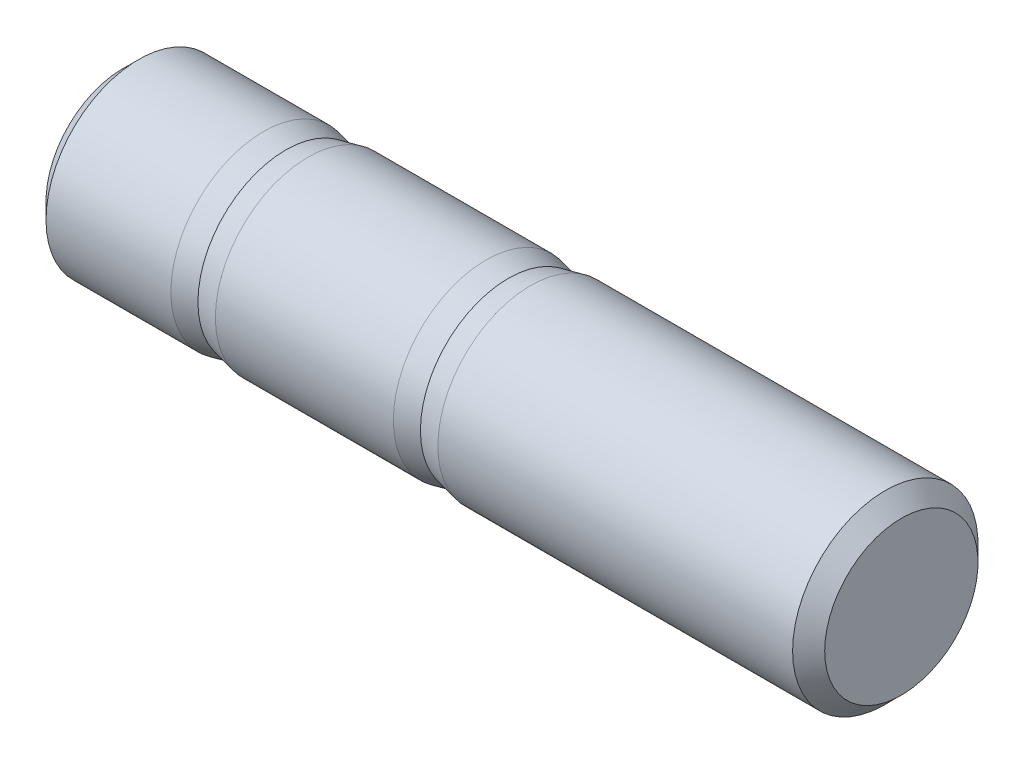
ISO-10303-21;
HEADER;
FILE_DESCRIPTION(('STEP AP214'),'2;1');
FILE_NAME('part.step','',(''),(''),'','','');
FILE_SCHEMA(('AUTOMOTIVE_DESIGN { 1 0 10303 214 1 1 1 1 }'));
ENDSEC;
DATA;
#1=APPLICATION_CONTEXT('core data for automotive mechanical design processes');
#2=APPLICATION_PROTOCOL_DEFINITION('international standard','automotive_design',2000,#1);
#3=PRODUCT_CONTEXT('',#1,'mechanical');
#4=PRODUCT('Part','Part','',(#3));
#5=PRODUCT_RELATED_PRODUCT_CATEGORY('part','',(#4));
#6=PRODUCT_DEFINITION_FORMATION('','',#4);
#7=PRODUCT_DEFINITION_CONTEXT('part definition',#1,'design');
#8=PRODUCT_DEFINITION('design','',#6,#7);
#9=PRODUCT_DEFINITION_SHAPE('','',#8);
#10=(LENGTH_UNIT() NAMED_UNIT(*) SI_UNIT(.MILLI.,.METRE.));
#11=(NAMED_UNIT(*) PLANE_ANGLE_UNIT() SI_UNIT($,.RADIAN.));
#12=(NAMED_UNIT(*) SI_UNIT($,.STERADIAN.) SOLID_ANGLE_UNIT());
#13=UNCERTAINTY_MEASURE_WITH_UNIT(LENGTH_MEASURE(1.E-05),#10,'distance_accuracy_value','');
#14=(GEOMETRIC_REPRESENTATION_CONTEXT(3) GLOBAL_UNCERTAINTY_ASSIGNED_CONTEXT((#13)) GLOBAL_UNIT_ASSIGNED_CONTEXT((#10,
#11,#12)) REPRESENTATION_CONTEXT('',''));
#15=CARTESIAN_POINT('',(0.,0.,0.));
#16=DIRECTION('',(0.,0.,1.));
#17=DIRECTION('',(1.,0.,0.));
#18=AXIS2_PLACEMENT_3D('',#15,#16,#17);
#19=CARTESIAN_POINT('',(5.,0.,0.));
#20=DIRECTION('',(-1.,0.,0.));
#21=DIRECTION('',(0.,0.,1.));
#22=AXIS2_PLACEMENT_3D('',#19,#20,#21);
#23=CONICAL_SURFACE('',#22,2.24,0.213368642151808);
#24=CARTESIAN_POINT('',(3.8,0.,0.));
#25=DIRECTION('',(-1.,0.,0.));
#26=DIRECTION('',(0.,0.,1.));
#27=AXIS2_PLACEMENT_3D('',#24,#25,#26);
#28=CIRCLE('',#27,2.5);
#29=CARTESIAN_POINT('',(3.8,0.,2.5));
#30=VERTEX_POINT('',#29);
#31=EDGE_CURVE('E54',#30,#30,#28,.T.);
#32=ORIENTED_EDGE('',*,*,#31,.F.);
#33=EDGE_LOOP('',(#32));
#34=FACE_BOUND('',#33,.T.);
#35=CARTESIAN_POINT('',(4.4,0.,0.));
#36=DIRECTION('',(1.,0.,0.));
#37=DIRECTION('',(0.,0.,-1.));
#38=AXIS2_PLACEMENT_3D('',#35,#36,#37);
#39=CIRCLE('',#38,2.37);
#40=CARTESIAN_POINT('',(4.4,0.,-2.37));
#41=VERTEX_POINT('',#40);
#42=EDGE_CURVE('E10',#41,#41,#39,.T.);
#43=ORIENTED_EDGE('',*,*,#42,.F.);
#44=EDGE_LOOP('',(#43));
#45=FACE_BOUND('',#44,.T.);
#46=ADVANCED_FACE('F28',(#34,#45),#23,.T.);
#47=CARTESIAN_POINT('',(0.,0.,0.));
#48=DIRECTION('',(1.,0.,0.));
#49=DIRECTION('',(0.,0.,-1.));
#50=AXIS2_PLACEMENT_3D('',#47,#48,#49);
#51=PLANE('',#50);
#52=CARTESIAN_POINT('',(0.,0.,0.));
#53=DIRECTION('',(1.,0.,0.));
#54=DIRECTION('',(0.,0.,-1.));
#55=AXIS2_PLACEMENT_3D('',#52,#53,#54);
#56=CIRCLE('',#55,2.067);
#57=CARTESIAN_POINT('',(0.,0.,-2.067));
#58=VERTEX_POINT('',#57);
#59=EDGE_CURVE('E51',#58,#58,#56,.F.);
#60=ORIENTED_EDGE('',*,*,#59,.T.);
#61=EDGE_LOOP('',(#60));
#62=FACE_BOUND('',#61,.T.);
#63=ADVANCED_FACE('F86',(#62),#51,.F.);
#64=CARTESIAN_POINT('',(-1.31084166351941,0.,0.));
#65=DIRECTION('',(-1.,0.,0.));
#66=DIRECTION('',(0.,0.,1.));
#67=AXIS2_PLACEMENT_3D('',#64,#65,#66);
#68=CYLINDRICAL_SURFACE('',#67,2.5);
#69=CARTESIAN_POINT('',(0.433,0.,0.));
#70=DIRECTION('',(1.,0.,0.));
#71=DIRECTION('',(0.,0.,-1.));
#72=AXIS2_PLACEMENT_3D('',#69,#70,#71);
#73=CIRCLE('',#72,2.5);
#74=CARTESIAN_POINT('',(0.433,0.,-2.5));
#75=VERTEX_POINT('',#74);
#76=EDGE_CURVE('E48',#75,#75,#73,.T.);
#77=ORIENTED_EDGE('',*,*,#76,.T.);
#78=EDGE_LOOP('',(#77));
#79=FACE_BOUND('',#78,.T.);
#80=ORIENTED_EDGE('',*,*,#31,.T.);
#81=EDGE_LOOP('',(#80));
#82=FACE_BOUND('',#81,.T.);
#83=ADVANCED_FACE('F92',(#79,#82),#68,.T.);
#84=CARTESIAN_POINT('',(0.,0.,0.));
#85=DIRECTION('',(1.,0.,0.));
#86=DIRECTION('',(0.,0.,-1.));
#87=AXIS2_PLACEMENT_3D('',#84,#85,#86);
#88=CONICAL_SURFACE('',#87,2.067,0.785398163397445);
#89=CARTESIAN_POINT('',(0.433,0.,-2.5));
#90=CARTESIAN_POINT('',(0.428489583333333,0.,-2.49548958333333));
#91=CARTESIAN_POINT('',(0.423979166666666,0.,-2.49097916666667));
#92=CARTESIAN_POINT('',(0.414958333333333,0.,-2.48195833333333));
#93=CARTESIAN_POINT('',(0.410447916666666,0.,-2.47744791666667));
#94=CARTESIAN_POINT('',(0.401427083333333,0.,-2.46842708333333));
#95=CARTESIAN_POINT('',(0.396916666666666,0.,-2.46391666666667));
#96=CARTESIAN_POINT('',(0.387895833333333,0.,-2.45489583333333));
#97=CARTESIAN_POINT('',(0.383385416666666,0.,-2.45038541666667));
#98=CARTESIAN_POINT('',(0.374364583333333,0.,-2.44136458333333));
#99=CARTESIAN_POINT('',(0.369854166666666,0.,-2.43685416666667));
#100=CARTESIAN_POINT('',(0.360833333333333,0.,-2.42783333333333));
#101=CARTESIAN_POINT('',(0.356322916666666,0.,-2.42332291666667));
#102=CARTESIAN_POINT('',(0.347302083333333,0.,-2.41430208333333));
#103=CARTESIAN_POINT('',(0.342791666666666,0.,-2.40979166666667));
#104=CARTESIAN_POINT('',(0.333770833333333,0.,-2.40077083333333));
#105=CARTESIAN_POINT('',(0.329260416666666,0.,-2.39626041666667));
#106=CARTESIAN_POINT('',(0.320239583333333,0.,-2.38723958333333));
#107=CARTESIAN_POINT('',(0.315729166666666,0.,-2.38272916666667));
#108=CARTESIAN_POINT('',(0.306708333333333,0.,-2.37370833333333));
#109=CARTESIAN_POINT('',(0.302197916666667,0.,-2.36919791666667));
#110=CARTESIAN_POINT('',(0.293177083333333,0.,-2.36017708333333));
#111=CARTESIAN_POINT('',(0.288666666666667,0.,-2.35566666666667));
#112=CARTESIAN_POINT('',(0.279645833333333,0.,-2.34664583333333));
#113=CARTESIAN_POINT('',(0.275135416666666,0.,-2.34213541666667));
#114=CARTESIAN_POINT('',(0.266114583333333,0.,-2.33311458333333));
#115=CARTESIAN_POINT('',(0.261604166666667,0.,-2.32860416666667));
#116=CARTESIAN_POINT('',(0.252583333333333,0.,-2.31958333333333));
#117=CARTESIAN_POINT('',(0.248072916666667,0.,-2.31507291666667));
#118=CARTESIAN_POINT('',(0.239052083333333,0.,-2.30605208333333));
#119=CARTESIAN_POINT('',(0.234541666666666,0.,-2.30154166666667));
#120=CARTESIAN_POINT('',(0.225520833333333,0.,-2.29252083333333));
#121=CARTESIAN_POINT('',(0.221010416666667,0.,-2.28801041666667));
#122=CARTESIAN_POINT('',(0.211989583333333,0.,-2.27898958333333));
#123=CARTESIAN_POINT('',(0.207479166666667,0.,-2.27447916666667));
#124=CARTESIAN_POINT('',(0.198458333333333,0.,-2.26545833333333));
#125=CARTESIAN_POINT('',(0.193947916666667,0.,-2.26094791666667));
#126=CARTESIAN_POINT('',(0.184927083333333,0.,-2.25192708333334));
#127=CARTESIAN_POINT('',(0.180416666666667,0.,-2.24741666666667));
#128=CARTESIAN_POINT('',(0.171395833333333,0.,-2.23839583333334));
#129=CARTESIAN_POINT('',(0.166885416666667,0.,-2.23388541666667));
#130=CARTESIAN_POINT('',(0.157864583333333,0.,-2.22486458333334));
#131=CARTESIAN_POINT('',(0.153354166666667,0.,-2.22035416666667));
#132=CARTESIAN_POINT('',(0.144333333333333,0.,-2.21133333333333));
#133=CARTESIAN_POINT('',(0.139822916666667,0.,-2.20682291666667));
#134=CARTESIAN_POINT('',(0.130802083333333,0.,-2.19780208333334));
#135=CARTESIAN_POINT('',(0.126291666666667,0.,-2.19329166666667));
#136=CARTESIAN_POINT('',(0.117270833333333,0.,-2.18427083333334));
#137=CARTESIAN_POINT('',(0.112760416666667,0.,-2.17976041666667));
#138=CARTESIAN_POINT('',(0.103739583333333,0.,-2.17073958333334));
#139=CARTESIAN_POINT('',(0.0992291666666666,0.,-2.16622916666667));
#140=CARTESIAN_POINT('',(0.0902083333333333,0.,-2.15720833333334));
#141=CARTESIAN_POINT('',(0.0856979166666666,0.,-2.15269791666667));
#142=CARTESIAN_POINT('',(0.0766770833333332,0.,-2.14367708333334));
#143=CARTESIAN_POINT('',(0.0721666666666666,0.,-2.13916666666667));
#144=CARTESIAN_POINT('',(0.0631458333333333,0.,-2.13014583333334));
#145=CARTESIAN_POINT('',(0.0586354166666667,0.,-2.12563541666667));
#146=CARTESIAN_POINT('',(0.0496145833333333,0.,-2.11661458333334));
#147=CARTESIAN_POINT('',(0.0451041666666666,0.,-2.11210416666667));
#148=CARTESIAN_POINT('',(0.0360833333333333,0.,-2.10308333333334));
#149=CARTESIAN_POINT('',(0.0315729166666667,0.,-2.09857291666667));
#150=CARTESIAN_POINT('',(0.0225520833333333,0.,-2.08955208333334));
#151=CARTESIAN_POINT('',(0.0180416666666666,0.,-2.08504166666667));
#152=CARTESIAN_POINT('',(0.00902083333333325,0.,-2.07602083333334));
#153=CARTESIAN_POINT('',(0.00451041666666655,0.,-2.07151041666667));
#154=CARTESIAN_POINT('',(0.,0.,-2.067));
#155=B_SPLINE_CURVE_WITH_KNOTS('',3,(#89,#90,#91,#92,#93,#94,#95,#96,#97,#98,#99,#100,#101,#102,
#103,#104,#105,#106,#107,#108,#109,#110,#111,#112,#113,#114,#115,#116,#117,#118,#119,#120,#121,
#122,#123,#124,#125,#126,#127,#128,#129,#130,#131,#132,#133,#134,#135,#136,#137,#138,#139,#140,
#141,#142,#143,#144,#145,#146,#147,#148,#149,#150,#151,#152,#153,#154),.UNSPECIFIED.,.F.,.F.,(4,
2,2,2,2,2,2,2,2,2,2,2,2,2,2,2,2,2,2,2,2,2,2,2,2,2,2,2,2,2,2,2,4),(0.,0.019136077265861,
0.0382721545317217,0.0574082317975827,0.0765443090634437,0.0956803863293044,0.114816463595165,
0.133952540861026,0.153088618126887,0.172224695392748,0.191360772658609,0.21049684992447,
0.22963292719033,0.248769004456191,0.267905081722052,0.287041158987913,0.306177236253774,
0.325313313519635,0.344449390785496,0.363585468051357,0.382721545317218,0.401857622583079,
0.420993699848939,0.4401297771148,0.459265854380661,0.478401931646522,0.497538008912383,
0.516674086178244,0.535810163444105,0.554946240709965,0.574082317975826,0.593218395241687,
0.612354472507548),.UNSPECIFIED.);
#156=EDGE_CURVE('BSEAM82',#75,#58,#155,.T.);
#157=ORIENTED_EDGE('',*,*,#76,.F.);
#158=ORIENTED_EDGE('',*,*,#59,.F.);
#159=ORIENTED_EDGE('',*,*,#156,.T.);
#160=ORIENTED_EDGE('',*,*,#156,.F.);
#161=EDGE_LOOP('',(#157,#159,#158,#160));
#162=FACE_BOUND('',#161,.T.);
#163=ADVANCED_FACE('F82',(#162),#88,.T.);
#164=CARTESIAN_POINT('',(5.,0.,0.));
#165=DIRECTION('',(1.,0.,0.));
#166=DIRECTION('',(0.,0.,-1.));
#167=AXIS2_PLACEMENT_3D('',#164,#165,#166);
#168=CONICAL_SURFACE('',#167,2.5,0.213368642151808);
#169=CARTESIAN_POINT('',(5.,0.,0.));
#170=DIRECTION('',(-1.,0.,0.));
#171=DIRECTION('',(0.,0.,1.));
#172=AXIS2_PLACEMENT_3D('',#169,#170,#171);
#173=CIRCLE('',#172,2.5);
#174=CARTESIAN_POINT('',(5.,0.,2.5));
#175=VERTEX_POINT('',#174);
#176=EDGE_CURVE('E63',#175,#175,#173,.T.);
#177=ORIENTED_EDGE('',*,*,#176,.T.);
#178=EDGE_LOOP('',(#177));
#179=FACE_BOUND('',#178,.T.);
#180=ORIENTED_EDGE('',*,*,#42,.T.);
#181=EDGE_LOOP('',(#180));
#182=FACE_BOUND('',#181,.T.);
#183=ADVANCED_FACE('F67',(#179,#182),#168,.T.);
#184=CARTESIAN_POINT('',(11.,0.,0.));
#185=DIRECTION('',(-1.,0.,0.));
#186=DIRECTION('',(0.,0.,1.));
#187=AXIS2_PLACEMENT_3D('',#184,#185,#186);
#188=CONICAL_SURFACE('',#187,2.24,0.213368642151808);
#189=CARTESIAN_POINT('',(9.8,0.,0.));
#190=DIRECTION('',(-1.,0.,0.));
#191=DIRECTION('',(0.,0.,1.));
#192=AXIS2_PLACEMENT_3D('',#189,#190,#191);
#193=CIRCLE('',#192,2.5);
#194=CARTESIAN_POINT('',(9.8,0.,2.5));
#195=VERTEX_POINT('',#194);
#196=EDGE_CURVE('E60',#195,#195,#193,.T.);
#197=ORIENTED_EDGE('',*,*,#196,.F.);
#198=EDGE_LOOP('',(#197));
#199=FACE_BOUND('',#198,.T.);
#200=CARTESIAN_POINT('',(10.4,0.,0.));
#201=DIRECTION('',(-1.,0.,0.));
#202=DIRECTION('',(0.,0.,1.));
#203=AXIS2_PLACEMENT_3D('',#200,#201,#202);
#204=CIRCLE('',#203,2.37);
#205=CARTESIAN_POINT('',(10.4,0.,2.37));
#206=VERTEX_POINT('',#205);
#207=EDGE_CURVE('E35',#206,#206,#204,.T.);
#208=ORIENTED_EDGE('',*,*,#207,.T.);
#209=EDGE_LOOP('',(#208));
#210=FACE_BOUND('',#209,.T.);
#211=ADVANCED_FACE('F73',(#199,#210),#188,.T.);
#212=CARTESIAN_POINT('',(4.97743089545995,0.,0.));
#213=DIRECTION('',(-1.,0.,0.));
#214=DIRECTION('',(0.,0.,1.));
#215=AXIS2_PLACEMENT_3D('',#212,#213,#214);
#216=CYLINDRICAL_SURFACE('',#215,2.5);
#217=ORIENTED_EDGE('',*,*,#176,.F.);
#218=EDGE_LOOP('',(#217));
#219=FACE_BOUND('',#218,.T.);
#220=ORIENTED_EDGE('',*,*,#196,.T.);
#221=EDGE_LOOP('',(#220));
#222=FACE_BOUND('',#221,.T.);
#223=ADVANCED_FACE('F69',(#219,#222),#216,.T.);
#224=CARTESIAN_POINT('',(21.,2.5,0.));
#225=DIRECTION('',(-1.,0.,0.));
#226=DIRECTION('',(0.,0.,1.));
#227=AXIS2_PLACEMENT_3D('',#224,#225,#226);
#228=PLANE('',#227);
#229=CARTESIAN_POINT('',(21.,0.,0.));
#230=DIRECTION('',(-1.,0.,0.));
#231=DIRECTION('',(0.,0.,1.));
#232=AXIS2_PLACEMENT_3D('',#229,#230,#231);
#233=CIRCLE('',#232,2.067);
#234=CARTESIAN_POINT('',(21.,0.,2.067));
#235=VERTEX_POINT('',#234);
#236=EDGE_CURVE('E39',#235,#235,#233,.F.);
#237=ORIENTED_EDGE('',*,*,#236,.T.);
#238=EDGE_LOOP('',(#237));
#239=FACE_BOUND('',#238,.T.);
#240=ADVANCED_FACE('F72',(#239),#228,.F.);
#241=CARTESIAN_POINT('',(20.567,0.,0.));
#242=DIRECTION('',(-1.,0.,0.));
#243=DIRECTION('',(0.,0.,1.));
#244=AXIS2_PLACEMENT_3D('',#241,#242,#243);
#245=CONICAL_SURFACE('',#244,2.5,0.785398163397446);
#246=ORIENTED_EDGE('',*,*,#236,.F.);
#247=EDGE_LOOP('',(#246));
#248=FACE_BOUND('',#247,.T.);
#249=CARTESIAN_POINT('',(20.567,0.,0.));
#250=DIRECTION('',(-1.,0.,0.));
#251=DIRECTION('',(0.,0.,1.));
#252=AXIS2_PLACEMENT_3D('',#249,#250,#251);
#253=CIRCLE('',#252,2.5);
#254=CARTESIAN_POINT('',(20.567,0.,2.5));
#255=VERTEX_POINT('',#254);
#256=EDGE_CURVE('E43',#255,#255,#253,.T.);
#257=ORIENTED_EDGE('',*,*,#256,.F.);
#258=EDGE_LOOP('',(#257));
#259=FACE_BOUND('',#258,.T.);
#260=ADVANCED_FACE('F30',(#248,#259),#245,.T.);
#261=CARTESIAN_POINT('',(-1.31084166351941,0.,0.));
#262=DIRECTION('',(-1.,0.,0.));
#263=DIRECTION('',(0.,0.,1.));
#264=AXIS2_PLACEMENT_3D('',#261,#262,#263);
#265=CYLINDRICAL_SURFACE('',#264,2.5);
#266=ORIENTED_EDGE('',*,*,#256,.T.);
#267=EDGE_LOOP('',(#266));
#268=FACE_BOUND('',#267,.T.);
#269=CARTESIAN_POINT('',(11.,0.,0.));
#270=DIRECTION('',(-1.,0.,0.));
#271=DIRECTION('',(0.,0.,1.));
#272=AXIS2_PLACEMENT_3D('',#269,#270,#271);
#273=CIRCLE('',#272,2.5);
#274=CARTESIAN_POINT('',(11.,0.,2.5));
#275=VERTEX_POINT('',#274);
#276=EDGE_CURVE('E57',#275,#275,#273,.T.);
#277=ORIENTED_EDGE('',*,*,#276,.F.);
#278=EDGE_LOOP('',(#277));
#279=FACE_BOUND('',#278,.T.);
#280=ADVANCED_FACE('F140',(#268,#279),#265,.T.);
#281=CARTESIAN_POINT('',(11.,0.,0.));
#282=DIRECTION('',(1.,0.,0.));
#283=DIRECTION('',(0.,0.,-1.));
#284=AXIS2_PLACEMENT_3D('',#281,#282,#283);
#285=CONICAL_SURFACE('',#284,2.5,0.213368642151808);
#286=ORIENTED_EDGE('',*,*,#276,.T.);
#287=EDGE_LOOP('',(#286));
#288=FACE_BOUND('',#287,.T.);
#289=ORIENTED_EDGE('',*,*,#207,.F.);
#290=EDGE_LOOP('',(#289));
#291=FACE_BOUND('',#290,.T.);
#292=ADVANCED_FACE('F99',(#288,#291),#285,.T.);
#293=CLOSED_SHELL('',(#46,#63,#83,#163,#183,#211,#223,#240,#260,#280,#292));
#294=MANIFOLD_SOLID_BREP('B2',#293);
#295=ADVANCED_BREP_SHAPE_REPRESENTATION('',(#18,#294),#14);
#296=SHAPE_DEFINITION_REPRESENTATION(#9,#295);
ENDSEC;
END-ISO-10303-21;
